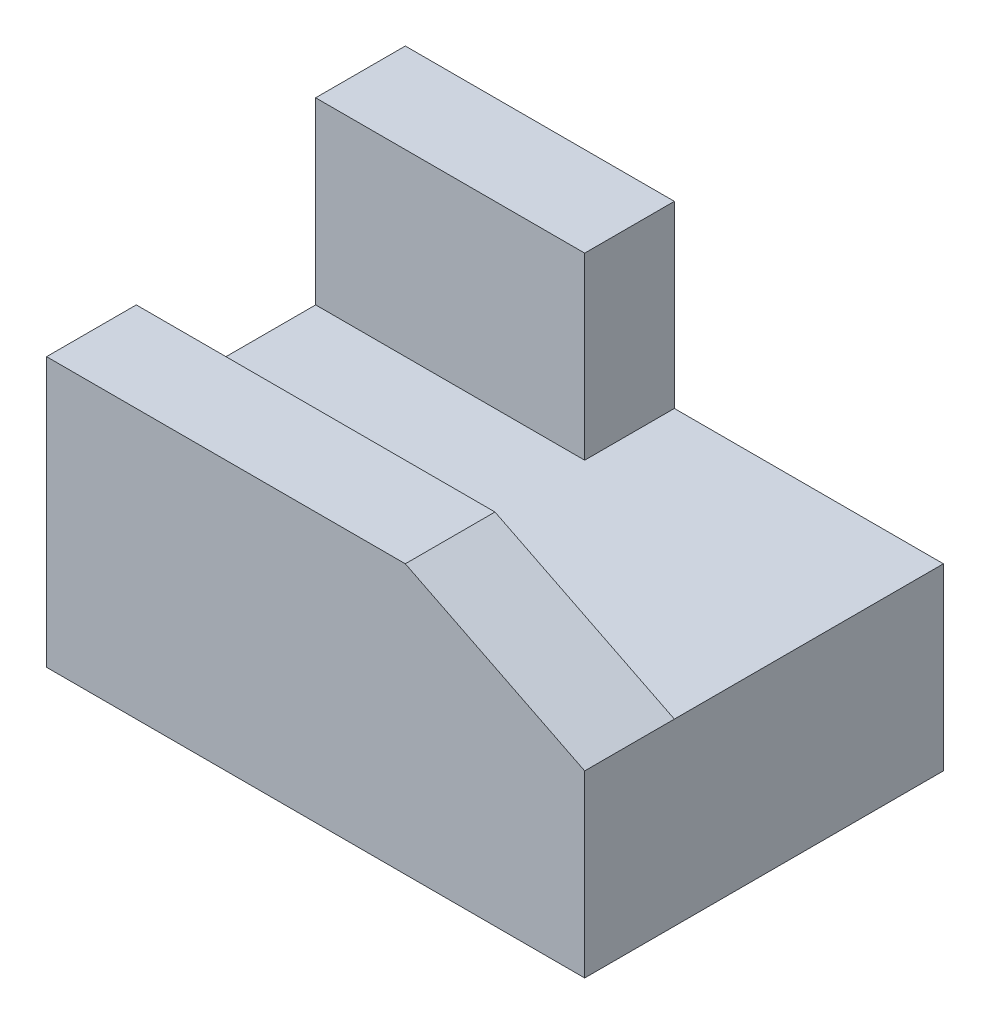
from build123d import *

# Parameters (mm, degrees)
SKETCH1_W      = 60
SKETCH1_H      = 40
EXTRUDE1_DEPTH = 20
EXTRUDE2_DEPTH = 10
SKETCH3_W      = 30
SKETCH3_H      = 20
EXTRUDE3_DEPTH = 10


with BuildPart() as part:
    # Sketch1 → Extrude1 (new body)
    with BuildSketch(Plane(origin=(0, 0, 0), x_dir=(1, 0, 0), z_dir=(0, 1, 0))):
        Rectangle(SKETCH1_W, SKETCH1_H)
    extrude(amount=EXTRUDE1_DEPTH)

    # Sketch2 → Extrude2 (add)
    with BuildSketch(Plane.XY.offset(20)):
        Polygon((-30, 20), (-30, 30), (10, 30), (30, 20), align=None)
    extrude(amount=-EXTRUDE2_DEPTH)

    # Sketch3 → Extrude3 (add)
    with BuildSketch(Plane(origin=(0, 0, -20), x_dir=(-1, 0, 0), z_dir=(0, 0, -1))):
        with Locations((15, 30)):
            Rectangle(SKETCH3_W, SKETCH3_H)
    extrude(amount=-EXTRUDE3_DEPTH)


solid = part.part
